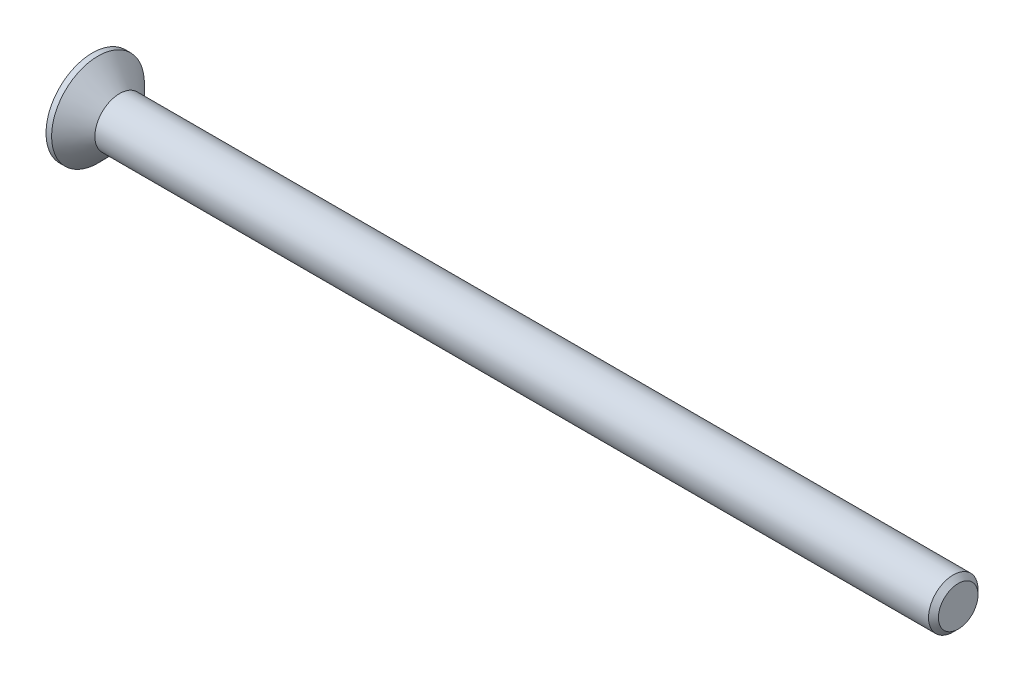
from build123d import *

# Parameters (mm, degrees)
CHAMFER1_SIZE      = 0.4
CUT_EXTRUDE1_DEPTH = 1.9


with BuildPart() as part:
    # Sketch1 → Revolve1 (revolve)
    with BuildSketch(Plane.XY, mode=Mode.PRIVATE) as revolve1_sk:
        Polygon((-2.2, 3.75), (-2.2, 0), (67.8, 0), (67.8, 2), (0, 2), (-1.75, 3.75), align=None)
    revolve(revolve1_sk.sketch.rotate(Axis((-2.2, 0, 0), (1, 0, 0)), 90), axis=Axis((-2.2, 0, 0), (1, 0, 0)))

    # Chamfer1
    chamfer1_edges = [part.edges().sort_by_distance(p)[0] for p in [
        (67.8, 0, -2),
    ]]
    chamfer(chamfer1_edges, length=CHAMFER1_SIZE)

    # Sketch2 → Cut-Extrude1 (cut)
    with BuildSketch(Plane.ZY.offset(2.2)):
        Polygon((-0.55, 2.2), (0.55, 2.2), (0.55, 0.55), (2.2, 0.55), (2.2, -0.55), (0.55, -0.55), (0.55, -2.2), (-0.55, -2.2), (-0.55, -0.55), (-2.2, -0.55), (-2.2, 0.55), (-0.55, 0.55), align=None)
    extrude(amount=-CUT_EXTRUDE1_DEPTH, mode=Mode.SUBTRACT)


solid = part.part
